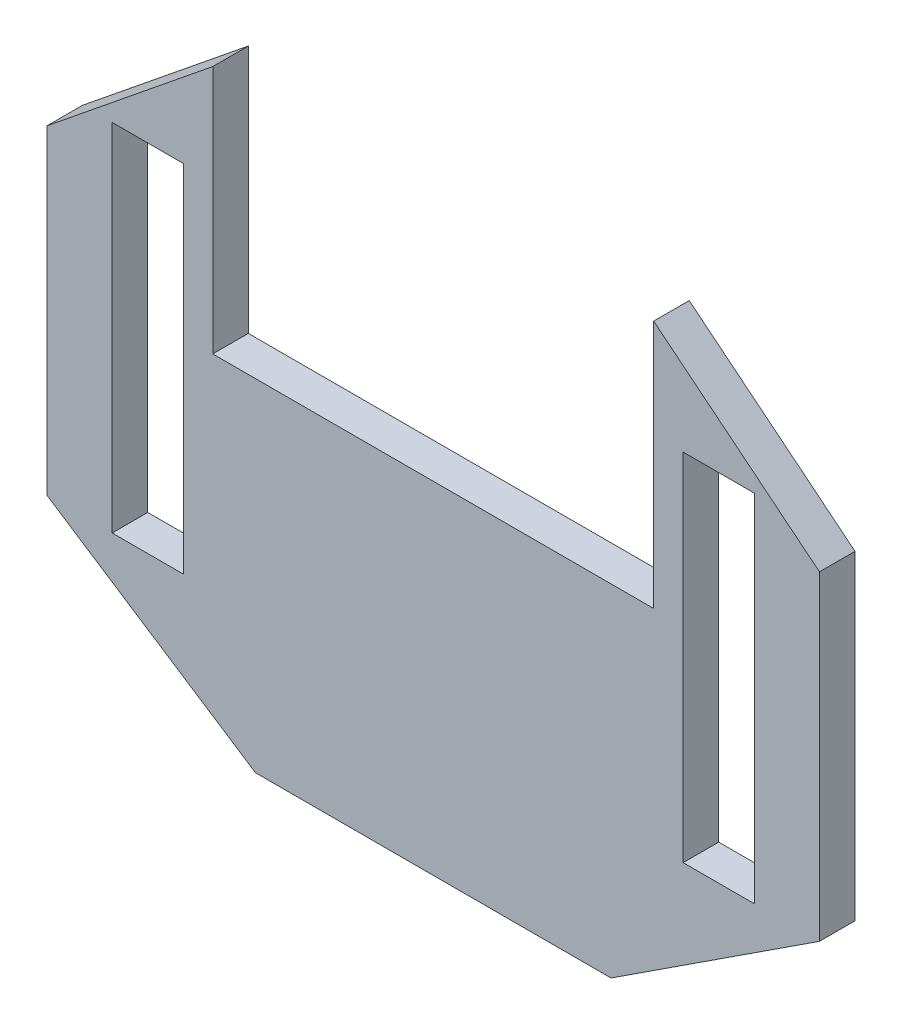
ISO-10303-21;
HEADER;
FILE_DESCRIPTION(('STEP AP214'),'2;1');
FILE_NAME('part.step','',(''),(''),'','','');
FILE_SCHEMA(('AUTOMOTIVE_DESIGN { 1 0 10303 214 1 1 1 1 }'));
ENDSEC;
DATA;
#1=APPLICATION_CONTEXT('core data for automotive mechanical design processes');
#2=APPLICATION_PROTOCOL_DEFINITION('international standard','automotive_design',2000,#1);
#3=PRODUCT_CONTEXT('',#1,'mechanical');
#4=PRODUCT('Part','Part','',(#3));
#5=PRODUCT_RELATED_PRODUCT_CATEGORY('part','',(#4));
#6=PRODUCT_DEFINITION_FORMATION('','',#4);
#7=PRODUCT_DEFINITION_CONTEXT('part definition',#1,'design');
#8=PRODUCT_DEFINITION('design','',#6,#7);
#9=PRODUCT_DEFINITION_SHAPE('','',#8);
#10=(LENGTH_UNIT() NAMED_UNIT(*) SI_UNIT(.MILLI.,.METRE.));
#11=(NAMED_UNIT(*) PLANE_ANGLE_UNIT() SI_UNIT($,.RADIAN.));
#12=(NAMED_UNIT(*) SI_UNIT($,.STERADIAN.) SOLID_ANGLE_UNIT());
#13=UNCERTAINTY_MEASURE_WITH_UNIT(LENGTH_MEASURE(1.E-05),#10,'distance_accuracy_value','');
#14=(GEOMETRIC_REPRESENTATION_CONTEXT(3) GLOBAL_UNCERTAINTY_ASSIGNED_CONTEXT((#13)) GLOBAL_UNIT_ASSIGNED_CONTEXT((#10,
#11,#12)) REPRESENTATION_CONTEXT('',''));
#15=CARTESIAN_POINT('',(0.,0.,0.));
#16=DIRECTION('',(0.,0.,1.));
#17=DIRECTION('',(1.,0.,0.));
#18=AXIS2_PLACEMENT_3D('',#15,#16,#17);
#19=CARTESIAN_POINT('',(0.,0.,10.));
#20=DIRECTION('',(0.,0.,-1.));
#21=DIRECTION('',(-1.,0.,0.));
#22=AXIS2_PLACEMENT_3D('',#19,#20,#21);
#23=PLANE('',#22);
#24=DIRECTION('',(-1.,0.,0.));
#25=VECTOR('',#24,1.);
#26=CARTESIAN_POINT('',(90.2943452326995,138.242595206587,10.));
#27=LINE('',#26,#25);
#28=CARTESIAN_POINT('',(90.2943452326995,138.242595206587,10.));
#29=VERTEX_POINT('',#28);
#30=CARTESIAN_POINT('',(70.2943452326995,138.242595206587,10.));
#31=VERTEX_POINT('',#30);
#32=EDGE_CURVE('E533',#29,#31,#27,.T.);
#33=ORIENTED_EDGE('',*,*,#32,.F.);
#34=DIRECTION('',(0.,1.,0.));
#35=VECTOR('',#34,1.);
#36=CARTESIAN_POINT('',(90.2943452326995,138.242595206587,10.));
#37=LINE('',#36,#35);
#38=CARTESIAN_POINT('',(90.2943452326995,38.2425952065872,10.));
#39=VERTEX_POINT('',#38);
#40=EDGE_CURVE('E543',#39,#29,#37,.T.);
#41=ORIENTED_EDGE('',*,*,#40,.F.);
#42=DIRECTION('',(1.,0.,0.));
#43=VECTOR('',#42,1.);
#44=CARTESIAN_POINT('',(90.2943452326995,38.2425952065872,10.));
#45=LINE('',#44,#43);
#46=CARTESIAN_POINT('',(70.2943452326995,38.2425952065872,10.));
#47=VERTEX_POINT('',#46);
#48=EDGE_CURVE('E548',#47,#39,#45,.T.);
#49=ORIENTED_EDGE('',*,*,#48,.F.);
#50=DIRECTION('',(0.,-1.,0.));
#51=VECTOR('',#50,1.);
#52=CARTESIAN_POINT('',(70.2943452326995,138.242595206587,10.));
#53=LINE('',#52,#51);
#54=EDGE_CURVE('E536',#31,#47,#53,.T.);
#55=ORIENTED_EDGE('',*,*,#54,.F.);
#56=EDGE_LOOP('',(#33,#41,#49,#55));
#57=FACE_BOUND('',#56,.T.);
#58=DIRECTION('',(0.,1.,0.));
#59=VECTOR('',#58,1.);
#60=CARTESIAN_POINT('',(-62.,96.,10.));
#61=LINE('',#60,#59);
#62=CARTESIAN_POINT('',(-62.,96.,10.));
#63=VERTEX_POINT('',#62);
#64=CARTESIAN_POINT('',(-62.,166.,10.));
#65=VERTEX_POINT('',#64);
#66=EDGE_CURVE('E230',#63,#65,#61,.T.);
#67=ORIENTED_EDGE('',*,*,#66,.T.);
#68=DIRECTION('',(-0.777170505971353,-0.629290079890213,0.));
#69=VECTOR('',#68,1.);
#70=CARTESIAN_POINT('',(-62.,166.,10.));
#71=LINE('',#70,#69);
#72=CARTESIAN_POINT('',(-108.630230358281,128.242595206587,10.));
#73=VERTEX_POINT('',#72);
#74=EDGE_CURVE('E322',#65,#73,#71,.T.);
#75=ORIENTED_EDGE('',*,*,#74,.T.);
#76=DIRECTION('',(0.,-1.,0.));
#77=VECTOR('',#76,1.);
#78=CARTESIAN_POINT('',(-108.630230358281,128.242595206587,10.));
#79=LINE('',#78,#77);
#80=CARTESIAN_POINT('',(-108.630230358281,38.2425952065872,10.));
#81=VERTEX_POINT('',#80);
#82=EDGE_CURVE('E260',#73,#81,#79,.T.);
#83=ORIENTED_EDGE('',*,*,#82,.T.);
#84=DIRECTION('',(0.837574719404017,-0.546322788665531,0.));
#85=VECTOR('',#84,1.);
#86=CARTESIAN_POINT('',(-108.630230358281,38.2425952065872,10.));
#87=LINE('',#86,#85);
#88=CARTESIAN_POINT('',(-50.,0.,10.));
#89=VERTEX_POINT('',#88);
#90=EDGE_CURVE('E282',#81,#89,#87,.T.);
#91=ORIENTED_EDGE('',*,*,#90,.T.);
#92=DIRECTION('',(1.,0.,0.));
#93=VECTOR('',#92,1.);
#94=CARTESIAN_POINT('',(-50.,0.,10.));
#95=LINE('',#94,#93);
#96=CARTESIAN_POINT('',(50.,0.,10.));
#97=VERTEX_POINT('',#96);
#98=EDGE_CURVE('E277',#89,#97,#95,.T.);
#99=ORIENTED_EDGE('',*,*,#98,.T.);
#100=DIRECTION('',(0.837574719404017,0.546322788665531,0.));
#101=VECTOR('',#100,1.);
#102=CARTESIAN_POINT('',(108.630230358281,38.2425952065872,10.));
#103=LINE('',#102,#101);
#104=CARTESIAN_POINT('',(108.630230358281,38.2425952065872,10.));
#105=VERTEX_POINT('',#104);
#106=EDGE_CURVE('E281',#97,#105,#103,.T.);
#107=ORIENTED_EDGE('',*,*,#106,.T.);
#108=DIRECTION('',(0.,1.,0.));
#109=VECTOR('',#108,1.);
#110=CARTESIAN_POINT('',(108.630230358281,128.242595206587,10.));
#111=LINE('',#110,#109);
#112=CARTESIAN_POINT('',(108.630230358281,128.242595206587,10.));
#113=VERTEX_POINT('',#112);
#114=EDGE_CURVE('E286',#105,#113,#111,.T.);
#115=ORIENTED_EDGE('',*,*,#114,.T.);
#116=DIRECTION('',(-0.777170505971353,0.629290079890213,0.));
#117=VECTOR('',#116,1.);
#118=CARTESIAN_POINT('',(62.,166.,10.));
#119=LINE('',#118,#117);
#120=CARTESIAN_POINT('',(62.,166.,10.));
#121=VERTEX_POINT('',#120);
#122=EDGE_CURVE('E301',#113,#121,#119,.T.);
#123=ORIENTED_EDGE('',*,*,#122,.T.);
#124=DIRECTION('',(0.,-1.,0.));
#125=VECTOR('',#124,1.);
#126=CARTESIAN_POINT('',(62.,96.,10.));
#127=LINE('',#126,#125);
#128=CARTESIAN_POINT('',(62.,96.,10.));
#129=VERTEX_POINT('',#128);
#130=EDGE_CURVE('E205',#121,#129,#127,.T.);
#131=ORIENTED_EDGE('',*,*,#130,.T.);
#132=DIRECTION('',(-1.,0.,0.));
#133=VECTOR('',#132,1.);
#134=CARTESIAN_POINT('',(62.,96.,10.));
#135=LINE('',#134,#133);
#136=EDGE_CURVE('E200',#129,#63,#135,.T.);
#137=ORIENTED_EDGE('',*,*,#136,.T.);
#138=EDGE_LOOP('',(#67,#75,#83,#91,#99,#107,#115,#123,#131,#137));
#139=FACE_BOUND('',#138,.T.);
#140=DIRECTION('',(0.,-1.,0.));
#141=VECTOR('',#140,1.);
#142=CARTESIAN_POINT('',(-90.2943452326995,138.242595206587,10.));
#143=LINE('',#142,#141);
#144=CARTESIAN_POINT('',(-90.2943452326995,138.242595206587,10.));
#145=VERTEX_POINT('',#144);
#146=CARTESIAN_POINT('',(-90.2943452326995,38.2425952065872,10.));
#147=VERTEX_POINT('',#146);
#148=EDGE_CURVE('E161',#145,#147,#143,.T.);
#149=ORIENTED_EDGE('',*,*,#148,.F.);
#150=DIRECTION('',(-1.,0.,0.));
#151=VECTOR('',#150,1.);
#152=CARTESIAN_POINT('',(-90.2943452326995,138.242595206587,10.));
#153=LINE('',#152,#151);
#154=CARTESIAN_POINT('',(-70.2943452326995,138.242595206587,10.));
#155=VERTEX_POINT('',#154);
#156=EDGE_CURVE('E185',#155,#145,#153,.T.);
#157=ORIENTED_EDGE('',*,*,#156,.F.);
#158=DIRECTION('',(0.,1.,0.));
#159=VECTOR('',#158,1.);
#160=CARTESIAN_POINT('',(-70.2943452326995,138.242595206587,10.));
#161=LINE('',#160,#159);
#162=CARTESIAN_POINT('',(-70.2943452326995,38.2425952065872,10.));
#163=VERTEX_POINT('',#162);
#164=EDGE_CURVE('E182',#163,#155,#161,.T.);
#165=ORIENTED_EDGE('',*,*,#164,.F.);
#166=DIRECTION('',(1.,0.,0.));
#167=VECTOR('',#166,1.);
#168=CARTESIAN_POINT('',(-90.2943452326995,38.2425952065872,10.));
#169=LINE('',#168,#167);
#170=EDGE_CURVE('E170',#147,#163,#169,.T.);
#171=ORIENTED_EDGE('',*,*,#170,.F.);
#172=EDGE_LOOP('',(#149,#157,#165,#171));
#173=FACE_BOUND('',#172,.T.);
#174=ADVANCED_FACE('F36',(#57,#139,#173),#23,.F.);
#175=CARTESIAN_POINT('',(0.,0.,0.));
#176=DIRECTION('',(0.,0.,-1.));
#177=DIRECTION('',(-1.,0.,0.));
#178=AXIS2_PLACEMENT_3D('',#175,#176,#177);
#179=PLANE('',#178);
#180=DIRECTION('',(0.,1.,0.));
#181=VECTOR('',#180,1.);
#182=CARTESIAN_POINT('',(90.2943452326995,138.242595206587,0.));
#183=LINE('',#182,#181);
#184=CARTESIAN_POINT('',(90.2943452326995,38.2425952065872,0.));
#185=VERTEX_POINT('',#184);
#186=CARTESIAN_POINT('',(90.2943452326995,138.242595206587,0.));
#187=VERTEX_POINT('',#186);
#188=EDGE_CURVE('E537',#185,#187,#183,.T.);
#189=ORIENTED_EDGE('',*,*,#188,.T.);
#190=DIRECTION('',(-1.,0.,0.));
#191=VECTOR('',#190,1.);
#192=CARTESIAN_POINT('',(90.2943452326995,138.242595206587,0.));
#193=LINE('',#192,#191);
#194=CARTESIAN_POINT('',(70.2943452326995,138.242595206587,0.));
#195=VERTEX_POINT('',#194);
#196=EDGE_CURVE('E178',#187,#195,#193,.T.);
#197=ORIENTED_EDGE('',*,*,#196,.T.);
#198=DIRECTION('',(0.,-1.,0.));
#199=VECTOR('',#198,1.);
#200=CARTESIAN_POINT('',(70.2943452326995,138.242595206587,0.));
#201=LINE('',#200,#199);
#202=CARTESIAN_POINT('',(70.2943452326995,38.2425952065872,0.));
#203=VERTEX_POINT('',#202);
#204=EDGE_CURVE('E552',#195,#203,#201,.T.);
#205=ORIENTED_EDGE('',*,*,#204,.T.);
#206=DIRECTION('',(1.,0.,0.));
#207=VECTOR('',#206,1.);
#208=CARTESIAN_POINT('',(90.2943452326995,38.2425952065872,0.));
#209=LINE('',#208,#207);
#210=EDGE_CURVE('E555',#203,#185,#209,.T.);
#211=ORIENTED_EDGE('',*,*,#210,.T.);
#212=EDGE_LOOP('',(#189,#197,#205,#211));
#213=FACE_BOUND('',#212,.T.);
#214=DIRECTION('',(0.,1.,0.));
#215=VECTOR('',#214,1.);
#216=CARTESIAN_POINT('',(-62.,96.,0.));
#217=LINE('',#216,#215);
#218=CARTESIAN_POINT('',(-62.,96.,0.));
#219=VERTEX_POINT('',#218);
#220=CARTESIAN_POINT('',(-62.,166.,0.));
#221=VERTEX_POINT('',#220);
#222=EDGE_CURVE('E208',#219,#221,#217,.T.);
#223=ORIENTED_EDGE('',*,*,#222,.F.);
#224=DIRECTION('',(-1.,0.,0.));
#225=VECTOR('',#224,1.);
#226=CARTESIAN_POINT('',(62.,96.,0.));
#227=LINE('',#226,#225);
#228=CARTESIAN_POINT('',(62.,96.,0.));
#229=VERTEX_POINT('',#228);
#230=EDGE_CURVE('E228',#229,#219,#227,.T.);
#231=ORIENTED_EDGE('',*,*,#230,.F.);
#232=DIRECTION('',(0.,-1.,0.));
#233=VECTOR('',#232,1.);
#234=CARTESIAN_POINT('',(62.,96.,0.));
#235=LINE('',#234,#233);
#236=CARTESIAN_POINT('',(62.,166.,0.));
#237=VERTEX_POINT('',#236);
#238=EDGE_CURVE('E226',#237,#229,#235,.T.);
#239=ORIENTED_EDGE('',*,*,#238,.F.);
#240=DIRECTION('',(-0.777170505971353,0.629290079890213,0.));
#241=VECTOR('',#240,1.);
#242=CARTESIAN_POINT('',(62.,166.,0.));
#243=LINE('',#242,#241);
#244=CARTESIAN_POINT('',(108.630230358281,128.242595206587,0.));
#245=VERTEX_POINT('',#244);
#246=EDGE_CURVE('E224',#245,#237,#243,.T.);
#247=ORIENTED_EDGE('',*,*,#246,.F.);
#248=DIRECTION('',(0.,1.,0.));
#249=VECTOR('',#248,1.);
#250=CARTESIAN_POINT('',(108.630230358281,128.242595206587,0.));
#251=LINE('',#250,#249);
#252=CARTESIAN_POINT('',(108.630230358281,38.2425952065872,0.));
#253=VERTEX_POINT('',#252);
#254=EDGE_CURVE('E222',#253,#245,#251,.T.);
#255=ORIENTED_EDGE('',*,*,#254,.F.);
#256=DIRECTION('',(0.837574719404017,0.546322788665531,0.));
#257=VECTOR('',#256,1.);
#258=CARTESIAN_POINT('',(108.630230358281,38.2425952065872,0.));
#259=LINE('',#258,#257);
#260=CARTESIAN_POINT('',(50.,0.,0.));
#261=VERTEX_POINT('',#260);
#262=EDGE_CURVE('E220',#261,#253,#259,.T.);
#263=ORIENTED_EDGE('',*,*,#262,.F.);
#264=DIRECTION('',(1.,0.,0.));
#265=VECTOR('',#264,1.);
#266=CARTESIAN_POINT('',(-50.,0.,0.));
#267=LINE('',#266,#265);
#268=CARTESIAN_POINT('',(-50.,0.,0.));
#269=VERTEX_POINT('',#268);
#270=EDGE_CURVE('E218',#269,#261,#267,.T.);
#271=ORIENTED_EDGE('',*,*,#270,.F.);
#272=DIRECTION('',(0.837574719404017,-0.546322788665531,0.));
#273=VECTOR('',#272,1.);
#274=CARTESIAN_POINT('',(-108.630230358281,38.2425952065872,0.));
#275=LINE('',#274,#273);
#276=CARTESIAN_POINT('',(-108.630230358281,38.2425952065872,0.));
#277=VERTEX_POINT('',#276);
#278=EDGE_CURVE('E216',#277,#269,#275,.T.);
#279=ORIENTED_EDGE('',*,*,#278,.F.);
#280=DIRECTION('',(0.,-1.,0.));
#281=VECTOR('',#280,1.);
#282=CARTESIAN_POINT('',(-108.630230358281,128.242595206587,0.));
#283=LINE('',#282,#281);
#284=CARTESIAN_POINT('',(-108.630230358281,128.242595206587,0.));
#285=VERTEX_POINT('',#284);
#286=EDGE_CURVE('E214',#285,#277,#283,.T.);
#287=ORIENTED_EDGE('',*,*,#286,.F.);
#288=DIRECTION('',(-0.777170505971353,-0.629290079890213,0.));
#289=VECTOR('',#288,1.);
#290=CARTESIAN_POINT('',(-62.,166.,0.));
#291=LINE('',#290,#289);
#292=EDGE_CURVE('E211',#221,#285,#291,.T.);
#293=ORIENTED_EDGE('',*,*,#292,.F.);
#294=EDGE_LOOP('',(#223,#231,#239,#247,#255,#263,#271,#279,#287,#293));
#295=FACE_BOUND('',#294,.T.);
#296=DIRECTION('',(-1.,0.,0.));
#297=VECTOR('',#296,1.);
#298=CARTESIAN_POINT('',(-90.2943452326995,138.242595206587,0.));
#299=LINE('',#298,#297);
#300=CARTESIAN_POINT('',(-70.2943452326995,138.242595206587,0.));
#301=VERTEX_POINT('',#300);
#302=CARTESIAN_POINT('',(-90.2943452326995,138.242595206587,0.));
#303=VERTEX_POINT('',#302);
#304=EDGE_CURVE('E171',#301,#303,#299,.T.);
#305=ORIENTED_EDGE('',*,*,#304,.T.);
#306=DIRECTION('',(0.,-1.,0.));
#307=VECTOR('',#306,1.);
#308=CARTESIAN_POINT('',(-90.2943452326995,138.242595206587,0.));
#309=LINE('',#308,#307);
#310=CARTESIAN_POINT('',(-90.2943452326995,38.2425952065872,0.));
#311=VERTEX_POINT('',#310);
#312=EDGE_CURVE('E59',#303,#311,#309,.T.);
#313=ORIENTED_EDGE('',*,*,#312,.T.);
#314=DIRECTION('',(1.,0.,0.));
#315=VECTOR('',#314,1.);
#316=CARTESIAN_POINT('',(-90.2943452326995,38.2425952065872,0.));
#317=LINE('',#316,#315);
#318=CARTESIAN_POINT('',(-70.2943452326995,38.2425952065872,0.));
#319=VERTEX_POINT('',#318);
#320=EDGE_CURVE('E177',#311,#319,#317,.T.);
#321=ORIENTED_EDGE('',*,*,#320,.T.);
#322=DIRECTION('',(0.,1.,0.));
#323=VECTOR('',#322,1.);
#324=CARTESIAN_POINT('',(-70.2943452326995,138.242595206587,0.));
#325=LINE('',#324,#323);
#326=EDGE_CURVE('E524',#319,#301,#325,.T.);
#327=ORIENTED_EDGE('',*,*,#326,.T.);
#328=EDGE_LOOP('',(#305,#313,#321,#327));
#329=FACE_BOUND('',#328,.T.);
#330=ADVANCED_FACE('F265',(#213,#295,#329),#179,.T.);
#331=CARTESIAN_POINT('',(-62.,96.,10.));
#332=DIRECTION('',(-1.,0.,0.));
#333=DIRECTION('',(0.,0.,1.));
#334=AXIS2_PLACEMENT_3D('',#331,#332,#333);
#335=PLANE('',#334);
#336=ORIENTED_EDGE('',*,*,#222,.T.);
#337=DIRECTION('',(0.,0.,-1.));
#338=VECTOR('',#337,1.);
#339=CARTESIAN_POINT('',(-62.,166.,10.));
#340=LINE('',#339,#338);
#341=EDGE_CURVE('E12',#65,#221,#340,.T.);
#342=ORIENTED_EDGE('',*,*,#341,.F.);
#343=ORIENTED_EDGE('',*,*,#66,.F.);
#344=DIRECTION('',(0.,0.,-1.));
#345=VECTOR('',#344,1.);
#346=CARTESIAN_POINT('',(-62.,96.,10.));
#347=LINE('',#346,#345);
#348=EDGE_CURVE('E204',#63,#219,#347,.T.);
#349=ORIENTED_EDGE('',*,*,#348,.T.);
#350=EDGE_LOOP('',(#336,#342,#343,#349));
#351=FACE_BOUND('',#350,.T.);
#352=ADVANCED_FACE('F38',(#351),#335,.F.);
#353=CARTESIAN_POINT('',(-62.,166.,10.));
#354=DIRECTION('',(0.629290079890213,-0.777170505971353,0.));
#355=DIRECTION('',(0.777170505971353,0.629290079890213,0.));
#356=AXIS2_PLACEMENT_3D('',#353,#354,#355);
#357=PLANE('',#356);
#358=ORIENTED_EDGE('',*,*,#292,.T.);
#359=DIRECTION('',(0.,0.,-1.));
#360=VECTOR('',#359,1.);
#361=CARTESIAN_POINT('',(-108.630230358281,128.242595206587,10.));
#362=LINE('',#361,#360);
#363=EDGE_CURVE('E44',#73,#285,#362,.T.);
#364=ORIENTED_EDGE('',*,*,#363,.F.);
#365=ORIENTED_EDGE('',*,*,#74,.F.);
#366=ORIENTED_EDGE('',*,*,#341,.T.);
#367=EDGE_LOOP('',(#358,#364,#365,#366));
#368=FACE_BOUND('',#367,.T.);
#369=ADVANCED_FACE('F338',(#368),#357,.F.);
#370=CARTESIAN_POINT('',(-108.630230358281,128.242595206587,10.));
#371=DIRECTION('',(1.,0.,0.));
#372=DIRECTION('',(0.,0.,-1.));
#373=AXIS2_PLACEMENT_3D('',#370,#371,#372);
#374=PLANE('',#373);
#375=ORIENTED_EDGE('',*,*,#286,.T.);
#376=DIRECTION('',(0.,0.,-1.));
#377=VECTOR('',#376,1.);
#378=CARTESIAN_POINT('',(-108.630230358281,38.2425952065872,10.));
#379=LINE('',#378,#377);
#380=EDGE_CURVE('E251',#81,#277,#379,.T.);
#381=ORIENTED_EDGE('',*,*,#380,.F.);
#382=ORIENTED_EDGE('',*,*,#82,.F.);
#383=ORIENTED_EDGE('',*,*,#363,.T.);
#384=EDGE_LOOP('',(#375,#381,#382,#383));
#385=FACE_BOUND('',#384,.T.);
#386=ADVANCED_FACE('F258',(#385),#374,.F.);
#387=CARTESIAN_POINT('',(-108.630230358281,38.2425952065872,10.));
#388=DIRECTION('',(0.546322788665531,0.837574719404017,0.));
#389=DIRECTION('',(-0.837574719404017,0.546322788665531,0.));
#390=AXIS2_PLACEMENT_3D('',#387,#388,#389);
#391=PLANE('',#390);
#392=ORIENTED_EDGE('',*,*,#278,.T.);
#393=DIRECTION('',(0.,0.,-1.));
#394=VECTOR('',#393,1.);
#395=CARTESIAN_POINT('',(-50.,0.,10.));
#396=LINE('',#395,#394);
#397=EDGE_CURVE('E248',#89,#269,#396,.T.);
#398=ORIENTED_EDGE('',*,*,#397,.F.);
#399=ORIENTED_EDGE('',*,*,#90,.F.);
#400=ORIENTED_EDGE('',*,*,#380,.T.);
#401=EDGE_LOOP('',(#392,#398,#399,#400));
#402=FACE_BOUND('',#401,.T.);
#403=ADVANCED_FACE('F271',(#402),#391,.F.);
#404=CARTESIAN_POINT('',(-50.,0.,10.));
#405=DIRECTION('',(0.,1.,0.));
#406=DIRECTION('',(0.,0.,1.));
#407=AXIS2_PLACEMENT_3D('',#404,#405,#406);
#408=PLANE('',#407);
#409=ORIENTED_EDGE('',*,*,#270,.T.);
#410=DIRECTION('',(0.,0.,-1.));
#411=VECTOR('',#410,1.);
#412=CARTESIAN_POINT('',(50.,0.,10.));
#413=LINE('',#412,#411);
#414=EDGE_CURVE('E245',#97,#261,#413,.T.);
#415=ORIENTED_EDGE('',*,*,#414,.F.);
#416=ORIENTED_EDGE('',*,*,#98,.F.);
#417=ORIENTED_EDGE('',*,*,#397,.T.);
#418=EDGE_LOOP('',(#409,#415,#416,#417));
#419=FACE_BOUND('',#418,.T.);
#420=ADVANCED_FACE('F275',(#419),#408,.F.);
#421=CARTESIAN_POINT('',(108.630230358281,38.2425952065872,10.));
#422=DIRECTION('',(-0.546322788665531,0.837574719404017,0.));
#423=DIRECTION('',(-0.837574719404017,-0.546322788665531,0.));
#424=AXIS2_PLACEMENT_3D('',#421,#422,#423);
#425=PLANE('',#424);
#426=ORIENTED_EDGE('',*,*,#262,.T.);
#427=DIRECTION('',(0.,0.,-1.));
#428=VECTOR('',#427,1.);
#429=CARTESIAN_POINT('',(108.630230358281,38.2425952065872,10.));
#430=LINE('',#429,#428);
#431=EDGE_CURVE('E242',#105,#253,#430,.T.);
#432=ORIENTED_EDGE('',*,*,#431,.F.);
#433=ORIENTED_EDGE('',*,*,#106,.F.);
#434=ORIENTED_EDGE('',*,*,#414,.T.);
#435=EDGE_LOOP('',(#426,#432,#433,#434));
#436=FACE_BOUND('',#435,.T.);
#437=ADVANCED_FACE('F349',(#436),#425,.F.);
#438=CARTESIAN_POINT('',(108.630230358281,128.242595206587,10.));
#439=DIRECTION('',(-1.,0.,0.));
#440=DIRECTION('',(0.,0.,1.));
#441=AXIS2_PLACEMENT_3D('',#438,#439,#440);
#442=PLANE('',#441);
#443=ORIENTED_EDGE('',*,*,#254,.T.);
#444=DIRECTION('',(0.,0.,-1.));
#445=VECTOR('',#444,1.);
#446=CARTESIAN_POINT('',(108.630230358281,128.242595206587,10.));
#447=LINE('',#446,#445);
#448=EDGE_CURVE('E239',#113,#245,#447,.T.);
#449=ORIENTED_EDGE('',*,*,#448,.F.);
#450=ORIENTED_EDGE('',*,*,#114,.F.);
#451=ORIENTED_EDGE('',*,*,#431,.T.);
#452=EDGE_LOOP('',(#443,#449,#450,#451));
#453=FACE_BOUND('',#452,.T.);
#454=ADVANCED_FACE('F346',(#453),#442,.F.);
#455=CARTESIAN_POINT('',(62.,166.,10.));
#456=DIRECTION('',(-0.629290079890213,-0.777170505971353,0.));
#457=DIRECTION('',(0.777170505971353,-0.629290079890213,0.));
#458=AXIS2_PLACEMENT_3D('',#455,#456,#457);
#459=PLANE('',#458);
#460=ORIENTED_EDGE('',*,*,#246,.T.);
#461=DIRECTION('',(0.,0.,-1.));
#462=VECTOR('',#461,1.);
#463=CARTESIAN_POINT('',(62.,166.,10.));
#464=LINE('',#463,#462);
#465=EDGE_CURVE('E236',#121,#237,#464,.T.);
#466=ORIENTED_EDGE('',*,*,#465,.F.);
#467=ORIENTED_EDGE('',*,*,#122,.F.);
#468=ORIENTED_EDGE('',*,*,#448,.T.);
#469=EDGE_LOOP('',(#460,#466,#467,#468));
#470=FACE_BOUND('',#469,.T.);
#471=ADVANCED_FACE('F342',(#470),#459,.F.);
#472=CARTESIAN_POINT('',(62.,96.,10.));
#473=DIRECTION('',(1.,0.,0.));
#474=DIRECTION('',(0.,0.,-1.));
#475=AXIS2_PLACEMENT_3D('',#472,#473,#474);
#476=PLANE('',#475);
#477=ORIENTED_EDGE('',*,*,#238,.T.);
#478=DIRECTION('',(0.,0.,-1.));
#479=VECTOR('',#478,1.);
#480=CARTESIAN_POINT('',(62.,96.,10.));
#481=LINE('',#480,#479);
#482=EDGE_CURVE('E233',#129,#229,#481,.T.);
#483=ORIENTED_EDGE('',*,*,#482,.F.);
#484=ORIENTED_EDGE('',*,*,#130,.F.);
#485=ORIENTED_EDGE('',*,*,#465,.T.);
#486=EDGE_LOOP('',(#477,#483,#484,#485));
#487=FACE_BOUND('',#486,.T.);
#488=ADVANCED_FACE('F313',(#487),#476,.F.);
#489=CARTESIAN_POINT('',(62.,96.,10.));
#490=DIRECTION('',(0.,-1.,0.));
#491=DIRECTION('',(0.,0.,-1.));
#492=AXIS2_PLACEMENT_3D('',#489,#490,#491);
#493=PLANE('',#492);
#494=ORIENTED_EDGE('',*,*,#230,.T.);
#495=ORIENTED_EDGE('',*,*,#348,.F.);
#496=ORIENTED_EDGE('',*,*,#136,.F.);
#497=ORIENTED_EDGE('',*,*,#482,.T.);
#498=EDGE_LOOP('',(#494,#495,#496,#497));
#499=FACE_BOUND('',#498,.T.);
#500=ADVANCED_FACE('F317',(#499),#493,.F.);
#501=CARTESIAN_POINT('',(90.2943452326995,138.242595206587,10.));
#502=DIRECTION('',(0.,-1.,0.));
#503=DIRECTION('',(0.,0.,-1.));
#504=AXIS2_PLACEMENT_3D('',#501,#502,#503);
#505=PLANE('',#504);
#506=ORIENTED_EDGE('',*,*,#196,.F.);
#507=DIRECTION('',(0.,0.,-1.));
#508=VECTOR('',#507,1.);
#509=CARTESIAN_POINT('',(90.2943452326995,138.242595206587,10.));
#510=LINE('',#509,#508);
#511=EDGE_CURVE('E547',#29,#187,#510,.T.);
#512=ORIENTED_EDGE('',*,*,#511,.F.);
#513=ORIENTED_EDGE('',*,*,#32,.T.);
#514=DIRECTION('',(0.,0.,-1.));
#515=VECTOR('',#514,1.);
#516=CARTESIAN_POINT('',(70.2943452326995,138.242595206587,10.));
#517=LINE('',#516,#515);
#518=EDGE_CURVE('E212',#31,#195,#517,.T.);
#519=ORIENTED_EDGE('',*,*,#518,.T.);
#520=EDGE_LOOP('',(#506,#512,#513,#519));
#521=FACE_BOUND('',#520,.T.);
#522=ADVANCED_FACE('F368',(#521),#505,.T.);
#523=CARTESIAN_POINT('',(70.2943452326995,138.242595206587,10.));
#524=DIRECTION('',(1.,0.,0.));
#525=DIRECTION('',(0.,1.,0.));
#526=AXIS2_PLACEMENT_3D('',#523,#524,#525);
#527=PLANE('',#526);
#528=ORIENTED_EDGE('',*,*,#204,.F.);
#529=ORIENTED_EDGE('',*,*,#518,.F.);
#530=ORIENTED_EDGE('',*,*,#54,.T.);
#531=DIRECTION('',(0.,0.,-1.));
#532=VECTOR('',#531,1.);
#533=CARTESIAN_POINT('',(70.2943452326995,38.2425952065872,10.));
#534=LINE('',#533,#532);
#535=EDGE_CURVE('E563',#47,#203,#534,.T.);
#536=ORIENTED_EDGE('',*,*,#535,.T.);
#537=EDGE_LOOP('',(#528,#529,#530,#536));
#538=FACE_BOUND('',#537,.T.);
#539=ADVANCED_FACE('F394',(#538),#527,.T.);
#540=CARTESIAN_POINT('',(90.2943452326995,38.2425952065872,10.));
#541=DIRECTION('',(0.,1.,0.));
#542=DIRECTION('',(-1.,0.,0.));
#543=AXIS2_PLACEMENT_3D('',#540,#541,#542);
#544=PLANE('',#543);
#545=ORIENTED_EDGE('',*,*,#210,.F.);
#546=ORIENTED_EDGE('',*,*,#535,.F.);
#547=ORIENTED_EDGE('',*,*,#48,.T.);
#548=DIRECTION('',(0.,0.,-1.));
#549=VECTOR('',#548,1.);
#550=CARTESIAN_POINT('',(90.2943452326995,38.2425952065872,10.));
#551=LINE('',#550,#549);
#552=EDGE_CURVE('E562',#39,#185,#551,.T.);
#553=ORIENTED_EDGE('',*,*,#552,.T.);
#554=EDGE_LOOP('',(#545,#546,#547,#553));
#555=FACE_BOUND('',#554,.T.);
#556=ADVANCED_FACE('F401',(#555),#544,.T.);
#557=CARTESIAN_POINT('',(90.2943452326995,138.242595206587,10.));
#558=DIRECTION('',(-1.,0.,0.));
#559=DIRECTION('',(0.,0.,1.));
#560=AXIS2_PLACEMENT_3D('',#557,#558,#559);
#561=PLANE('',#560);
#562=ORIENTED_EDGE('',*,*,#188,.F.);
#563=ORIENTED_EDGE('',*,*,#552,.F.);
#564=ORIENTED_EDGE('',*,*,#40,.T.);
#565=ORIENTED_EDGE('',*,*,#511,.T.);
#566=EDGE_LOOP('',(#562,#563,#564,#565));
#567=FACE_BOUND('',#566,.T.);
#568=ADVANCED_FACE('F408',(#567),#561,.T.);
#569=CARTESIAN_POINT('',(-90.2943452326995,138.242595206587,10.));
#570=DIRECTION('',(1.,0.,0.));
#571=DIRECTION('',(0.,0.,-1.));
#572=AXIS2_PLACEMENT_3D('',#569,#570,#571);
#573=PLANE('',#572);
#574=ORIENTED_EDGE('',*,*,#312,.F.);
#575=DIRECTION('',(0.,0.,-1.));
#576=VECTOR('',#575,1.);
#577=CARTESIAN_POINT('',(-90.2943452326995,138.242595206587,10.));
#578=LINE('',#577,#576);
#579=EDGE_CURVE('E165',#145,#303,#578,.T.);
#580=ORIENTED_EDGE('',*,*,#579,.F.);
#581=ORIENTED_EDGE('',*,*,#148,.T.);
#582=DIRECTION('',(0.,0.,-1.));
#583=VECTOR('',#582,1.);
#584=CARTESIAN_POINT('',(-90.2943452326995,38.2425952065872,10.));
#585=LINE('',#584,#583);
#586=EDGE_CURVE('E164',#147,#311,#585,.T.);
#587=ORIENTED_EDGE('',*,*,#586,.T.);
#588=EDGE_LOOP('',(#574,#580,#581,#587));
#589=FACE_BOUND('',#588,.T.);
#590=ADVANCED_FACE('F163',(#589),#573,.T.);
#591=CARTESIAN_POINT('',(-90.2943452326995,38.2425952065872,10.));
#592=DIRECTION('',(0.,1.,0.));
#593=DIRECTION('',(-1.,0.,0.));
#594=AXIS2_PLACEMENT_3D('',#591,#592,#593);
#595=PLANE('',#594);
#596=ORIENTED_EDGE('',*,*,#320,.F.);
#597=ORIENTED_EDGE('',*,*,#586,.F.);
#598=ORIENTED_EDGE('',*,*,#170,.T.);
#599=DIRECTION('',(0.,0.,-1.));
#600=VECTOR('',#599,1.);
#601=CARTESIAN_POINT('',(-70.2943452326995,38.2425952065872,10.));
#602=LINE('',#601,#600);
#603=EDGE_CURVE('E179',#163,#319,#602,.T.);
#604=ORIENTED_EDGE('',*,*,#603,.T.);
#605=EDGE_LOOP('',(#596,#597,#598,#604));
#606=FACE_BOUND('',#605,.T.);
#607=ADVANCED_FACE('F174',(#606),#595,.T.);
#608=CARTESIAN_POINT('',(-70.2943452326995,138.242595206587,10.));
#609=DIRECTION('',(-1.,0.,0.));
#610=DIRECTION('',(0.,-1.,0.));
#611=AXIS2_PLACEMENT_3D('',#608,#609,#610);
#612=PLANE('',#611);
#613=ORIENTED_EDGE('',*,*,#326,.F.);
#614=ORIENTED_EDGE('',*,*,#603,.F.);
#615=ORIENTED_EDGE('',*,*,#164,.T.);
#616=DIRECTION('',(0.,0.,-1.));
#617=VECTOR('',#616,1.);
#618=CARTESIAN_POINT('',(-70.2943452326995,138.242595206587,10.));
#619=LINE('',#618,#617);
#620=EDGE_CURVE('E51',#155,#301,#619,.T.);
#621=ORIENTED_EDGE('',*,*,#620,.T.);
#622=EDGE_LOOP('',(#613,#614,#615,#621));
#623=FACE_BOUND('',#622,.T.);
#624=ADVANCED_FACE('F429',(#623),#612,.T.);
#625=CARTESIAN_POINT('',(-90.2943452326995,138.242595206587,10.));
#626=DIRECTION('',(0.,-1.,0.));
#627=DIRECTION('',(0.,0.,-1.));
#628=AXIS2_PLACEMENT_3D('',#625,#626,#627);
#629=PLANE('',#628);
#630=ORIENTED_EDGE('',*,*,#304,.F.);
#631=ORIENTED_EDGE('',*,*,#620,.F.);
#632=ORIENTED_EDGE('',*,*,#156,.T.);
#633=ORIENTED_EDGE('',*,*,#579,.T.);
#634=EDGE_LOOP('',(#630,#631,#632,#633));
#635=FACE_BOUND('',#634,.T.);
#636=ADVANCED_FACE('F436',(#635),#629,.T.);
#637=CLOSED_SHELL('',(#174,#330,#352,#369,#386,#403,#420,#437,#454,#471,#488,#500,#522,#539,
#556,#568,#590,#607,#624,#636));
#638=MANIFOLD_SOLID_BREP('B2',#637);
#639=ADVANCED_BREP_SHAPE_REPRESENTATION('',(#18,#638),#14);
#640=SHAPE_DEFINITION_REPRESENTATION(#9,#639);
ENDSEC;
END-ISO-10303-21;
